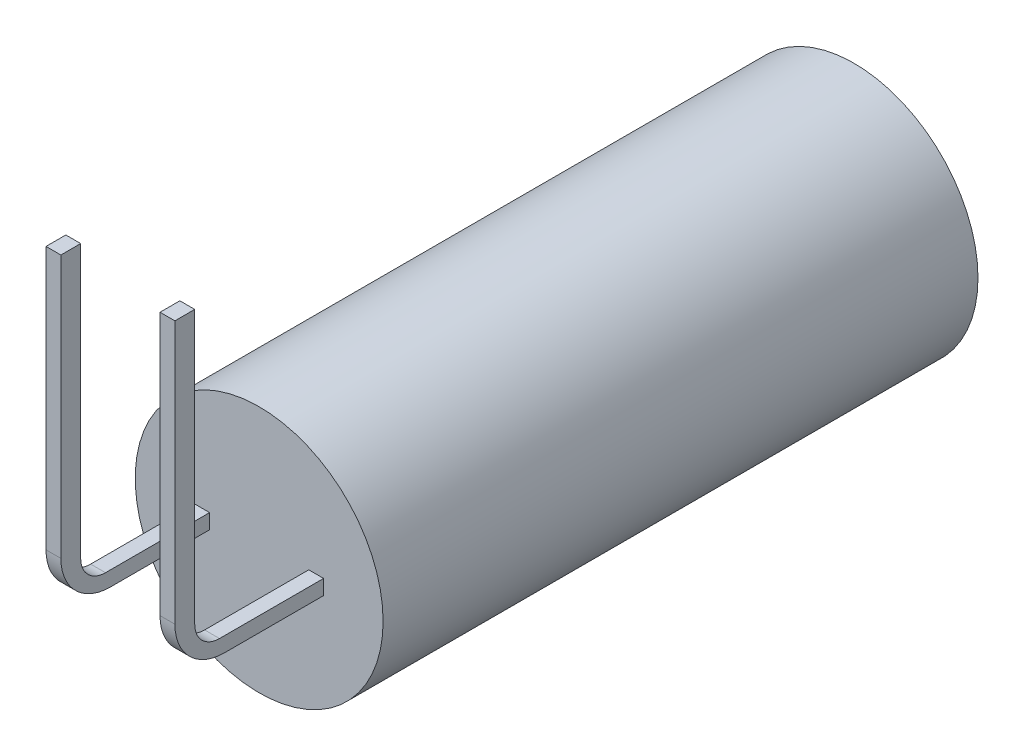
ISO-10303-21;
HEADER;
FILE_DESCRIPTION(('STEP AP214'),'2;1');
FILE_NAME('part.step','',(''),(''),'','','');
FILE_SCHEMA(('AUTOMOTIVE_DESIGN { 1 0 10303 214 1 1 1 1 }'));
ENDSEC;
DATA;
#1=APPLICATION_CONTEXT('core data for automotive mechanical design processes');
#2=APPLICATION_PROTOCOL_DEFINITION('international standard','automotive_design',2000,#1);
#3=PRODUCT_CONTEXT('',#1,'mechanical');
#4=PRODUCT('Part','Part','',(#3));
#5=PRODUCT_RELATED_PRODUCT_CATEGORY('part','',(#4));
#6=PRODUCT_DEFINITION_FORMATION('','',#4);
#7=PRODUCT_DEFINITION_CONTEXT('part definition',#1,'design');
#8=PRODUCT_DEFINITION('design','',#6,#7);
#9=PRODUCT_DEFINITION_SHAPE('','',#8);
#10=(LENGTH_UNIT() NAMED_UNIT(*) SI_UNIT(.MILLI.,.METRE.));
#11=(NAMED_UNIT(*) PLANE_ANGLE_UNIT() SI_UNIT($,.RADIAN.));
#12=(NAMED_UNIT(*) SI_UNIT($,.STERADIAN.) SOLID_ANGLE_UNIT());
#13=UNCERTAINTY_MEASURE_WITH_UNIT(LENGTH_MEASURE(1.E-05),#10,'distance_accuracy_value','');
#14=(GEOMETRIC_REPRESENTATION_CONTEXT(3) GLOBAL_UNCERTAINTY_ASSIGNED_CONTEXT((#13)) GLOBAL_UNIT_ASSIGNED_CONTEXT((#10,
#11,#12)) REPRESENTATION_CONTEXT('',''));
#15=CARTESIAN_POINT('',(0.,0.,0.));
#16=DIRECTION('',(0.,0.,1.));
#17=DIRECTION('',(1.,0.,0.));
#18=AXIS2_PLACEMENT_3D('',#15,#16,#17);
#19=CARTESIAN_POINT('',(-1.3,0.15,3.));
#20=DIRECTION('',(0.,-1.,0.));
#21=DIRECTION('',(0.,0.,-1.));
#22=AXIS2_PLACEMENT_3D('',#19,#20,#21);
#23=PLANE('',#22);
#24=DIRECTION('',(0.,0.,-1.));
#25=VECTOR('',#24,1.);
#26=CARTESIAN_POINT('',(-1.3,0.15,3.));
#27=LINE('',#26,#25);
#28=CARTESIAN_POINT('',(-1.3,0.15,2.1));
#29=VERTEX_POINT('',#28);
#30=CARTESIAN_POINT('',(-1.3,0.15,0.));
#31=VERTEX_POINT('',#30);
#32=EDGE_CURVE('E229',#29,#31,#27,.T.);
#33=ORIENTED_EDGE('',*,*,#32,.F.);
#34=DIRECTION('',(-1.,0.,0.));
#35=VECTOR('',#34,1.);
#36=CARTESIAN_POINT('',(-1.,0.15,2.1));
#37=LINE('',#36,#35);
#38=CARTESIAN_POINT('',(-1.,0.15,2.1));
#39=VERTEX_POINT('',#38);
#40=EDGE_CURVE('E52',#29,#39,#37,.F.);
#41=ORIENTED_EDGE('',*,*,#40,.T.);
#42=DIRECTION('',(0.,0.,-1.));
#43=VECTOR('',#42,1.);
#44=CARTESIAN_POINT('',(-1.,0.15,3.));
#45=LINE('',#44,#43);
#46=CARTESIAN_POINT('',(-1.,0.15,0.));
#47=VERTEX_POINT('',#46);
#48=EDGE_CURVE('E231',#39,#47,#45,.T.);
#49=ORIENTED_EDGE('',*,*,#48,.T.);
#50=DIRECTION('',(-1.,0.,0.));
#51=VECTOR('',#50,1.);
#52=CARTESIAN_POINT('',(-1.3,0.15,0.));
#53=LINE('',#52,#51);
#54=EDGE_CURVE('E221',#47,#31,#53,.T.);
#55=ORIENTED_EDGE('',*,*,#54,.T.);
#56=EDGE_LOOP('',(#33,#41,#49,#55));
#57=FACE_BOUND('',#56,.T.);
#58=ADVANCED_FACE('F31',(#57),#23,.F.);
#59=CARTESIAN_POINT('',(1.3,0.15,3.));
#60=DIRECTION('',(0.,-1.,0.));
#61=DIRECTION('',(1.,0.,0.));
#62=AXIS2_PLACEMENT_3D('',#59,#60,#61);
#63=PLANE('',#62);
#64=DIRECTION('',(0.,0.,-1.));
#65=VECTOR('',#64,1.);
#66=CARTESIAN_POINT('',(1.,0.15,3.));
#67=LINE('',#66,#65);
#68=CARTESIAN_POINT('',(1.,0.15,2.1));
#69=VERTEX_POINT('',#68);
#70=CARTESIAN_POINT('',(1.,0.15,0.));
#71=VERTEX_POINT('',#70);
#72=EDGE_CURVE('E210',#69,#71,#67,.T.);
#73=ORIENTED_EDGE('',*,*,#72,.F.);
#74=DIRECTION('',(-1.,0.,0.));
#75=VECTOR('',#74,1.);
#76=CARTESIAN_POINT('',(1.3,0.15,2.1));
#77=LINE('',#76,#75);
#78=CARTESIAN_POINT('',(1.3,0.15,2.1));
#79=VERTEX_POINT('',#78);
#80=EDGE_CURVE('E264',#69,#79,#77,.F.);
#81=ORIENTED_EDGE('',*,*,#80,.T.);
#82=DIRECTION('',(0.,0.,-1.));
#83=VECTOR('',#82,1.);
#84=CARTESIAN_POINT('',(1.3,0.15,3.));
#85=LINE('',#84,#83);
#86=CARTESIAN_POINT('',(1.3,0.15,0.));
#87=VERTEX_POINT('',#86);
#88=EDGE_CURVE('E204',#79,#87,#85,.T.);
#89=ORIENTED_EDGE('',*,*,#88,.T.);
#90=DIRECTION('',(-1.,0.,0.));
#91=VECTOR('',#90,1.);
#92=CARTESIAN_POINT('',(1.3,0.15,0.));
#93=LINE('',#92,#91);
#94=EDGE_CURVE('E187',#87,#71,#93,.T.);
#95=ORIENTED_EDGE('',*,*,#94,.T.);
#96=EDGE_LOOP('',(#73,#81,#89,#95));
#97=FACE_BOUND('',#96,.T.);
#98=ADVANCED_FACE('F292',(#97),#63,.F.);
#99=CARTESIAN_POINT('',(0.,0.,0.));
#100=DIRECTION('',(0.,0.,1.));
#101=DIRECTION('',(1.,0.,0.));
#102=AXIS2_PLACEMENT_3D('',#99,#100,#101);
#103=PLANE('',#102);
#104=DIRECTION('',(1.,0.,0.));
#105=VECTOR('',#104,1.);
#106=CARTESIAN_POINT('',(-1.3,-0.15,0.));
#107=LINE('',#106,#105);
#108=CARTESIAN_POINT('',(-1.3,-0.15,0.));
#109=VERTEX_POINT('',#108);
#110=CARTESIAN_POINT('',(-1.,-0.15,0.));
#111=VERTEX_POINT('',#110);
#112=EDGE_CURVE('E215',#109,#111,#107,.T.);
#113=ORIENTED_EDGE('',*,*,#112,.F.);
#114=DIRECTION('',(0.,-1.,0.));
#115=VECTOR('',#114,1.);
#116=CARTESIAN_POINT('',(-1.3,0.15,0.));
#117=LINE('',#116,#115);
#118=EDGE_CURVE('E212',#31,#109,#117,.T.);
#119=ORIENTED_EDGE('',*,*,#118,.F.);
#120=ORIENTED_EDGE('',*,*,#54,.F.);
#121=DIRECTION('',(0.,1.,0.));
#122=VECTOR('',#121,1.);
#123=CARTESIAN_POINT('',(-1.,0.15,0.));
#124=LINE('',#123,#122);
#125=EDGE_CURVE('E218',#111,#47,#124,.T.);
#126=ORIENTED_EDGE('',*,*,#125,.F.);
#127=EDGE_LOOP('',(#113,#119,#120,#126));
#128=FACE_BOUND('',#127,.T.);
#129=CARTESIAN_POINT('',(0.,0.,0.));
#130=DIRECTION('',(0.,0.,1.));
#131=DIRECTION('',(1.,0.,0.));
#132=AXIS2_PLACEMENT_3D('',#129,#130,#131);
#133=CIRCLE('',#132,2.5);
#134=CARTESIAN_POINT('',(2.5,0.,0.));
#135=VERTEX_POINT('',#134);
#136=EDGE_CURVE('E237',#135,#135,#133,.T.);
#137=ORIENTED_EDGE('',*,*,#136,.T.);
#138=EDGE_LOOP('',(#137));
#139=FACE_BOUND('',#138,.T.);
#140=DIRECTION('',(0.,-1.,0.));
#141=VECTOR('',#140,1.);
#142=CARTESIAN_POINT('',(1.,0.15,0.));
#143=LINE('',#142,#141);
#144=CARTESIAN_POINT('',(1.,-0.15,0.));
#145=VERTEX_POINT('',#144);
#146=EDGE_CURVE('E190',#71,#145,#143,.T.);
#147=ORIENTED_EDGE('',*,*,#146,.F.);
#148=ORIENTED_EDGE('',*,*,#94,.F.);
#149=DIRECTION('',(0.,1.,0.));
#150=VECTOR('',#149,1.);
#151=CARTESIAN_POINT('',(1.3,0.15,0.));
#152=LINE('',#151,#150);
#153=CARTESIAN_POINT('',(1.3,-0.15,0.));
#154=VERTEX_POINT('',#153);
#155=EDGE_CURVE('E196',#154,#87,#152,.T.);
#156=ORIENTED_EDGE('',*,*,#155,.F.);
#157=DIRECTION('',(1.,0.,0.));
#158=VECTOR('',#157,1.);
#159=CARTESIAN_POINT('',(1.3,-0.15,0.));
#160=LINE('',#159,#158);
#161=EDGE_CURVE('E193',#145,#154,#160,.T.);
#162=ORIENTED_EDGE('',*,*,#161,.F.);
#163=EDGE_LOOP('',(#147,#148,#156,#162));
#164=FACE_BOUND('',#163,.T.);
#165=ADVANCED_FACE('F298',(#128,#139,#164),#103,.T.);
#166=CARTESIAN_POINT('',(0.,0.,-12.));
#167=DIRECTION('',(0.,0.,1.));
#168=DIRECTION('',(1.,0.,0.));
#169=AXIS2_PLACEMENT_3D('',#166,#167,#168);
#170=CYLINDRICAL_SURFACE('',#169,2.5);
#171=CARTESIAN_POINT('',(0.,0.,-12.));
#172=DIRECTION('',(0.,0.,1.));
#173=DIRECTION('',(1.,0.,0.));
#174=AXIS2_PLACEMENT_3D('',#171,#172,#173);
#175=CIRCLE('',#174,2.5);
#176=CARTESIAN_POINT('',(2.5,0.,-12.));
#177=VERTEX_POINT('',#176);
#178=EDGE_CURVE('E240',#177,#177,#175,.T.);
#179=ORIENTED_EDGE('',*,*,#178,.T.);
#180=EDGE_LOOP('',(#179));
#181=FACE_BOUND('',#180,.T.);
#182=ORIENTED_EDGE('',*,*,#136,.F.);
#183=EDGE_LOOP('',(#182));
#184=FACE_BOUND('',#183,.T.);
#185=ADVANCED_FACE('F33',(#181,#184),#170,.T.);
#186=CARTESIAN_POINT('',(0.,0.,-12.));
#187=DIRECTION('',(0.,0.,1.));
#188=DIRECTION('',(1.,0.,0.));
#189=AXIS2_PLACEMENT_3D('',#186,#187,#188);
#190=PLANE('',#189);
#191=ORIENTED_EDGE('',*,*,#178,.F.);
#192=EDGE_LOOP('',(#191));
#193=FACE_BOUND('',#192,.T.);
#194=ADVANCED_FACE('F337',(#193),#190,.F.);
#195=CARTESIAN_POINT('',(-1.3,0.15,3.));
#196=DIRECTION('',(1.,0.,0.));
#197=DIRECTION('',(0.,0.,-1.));
#198=AXIS2_PLACEMENT_3D('',#195,#196,#197);
#199=PLANE('',#198);
#200=DIRECTION('',(0.,0.,-1.));
#201=VECTOR('',#200,1.);
#202=CARTESIAN_POINT('',(-1.3,-0.15,3.));
#203=LINE('',#202,#201);
#204=CARTESIAN_POINT('',(-1.3,-0.15,2.));
#205=VERTEX_POINT('',#204);
#206=EDGE_CURVE('E235',#205,#109,#203,.T.);
#207=ORIENTED_EDGE('',*,*,#206,.F.);
#208=CARTESIAN_POINT('',(-1.3,0.85,2.));
#209=DIRECTION('',(1.,0.,0.));
#210=DIRECTION('',(0.,0.,-1.));
#211=AXIS2_PLACEMENT_3D('',#208,#209,#210);
#212=CIRCLE('',#211,1.);
#213=CARTESIAN_POINT('',(-1.3,0.85,3.));
#214=VERTEX_POINT('',#213);
#215=EDGE_CURVE('E250',#205,#214,#212,.F.);
#216=ORIENTED_EDGE('',*,*,#215,.T.);
#217=DIRECTION('',(0.,-1.,0.));
#218=VECTOR('',#217,1.);
#219=CARTESIAN_POINT('',(-1.3,0.15,3.));
#220=LINE('',#219,#218);
#221=CARTESIAN_POINT('',(-1.3,6.15,3.));
#222=VERTEX_POINT('',#221);
#223=EDGE_CURVE('E224',#222,#214,#220,.T.);
#224=ORIENTED_EDGE('',*,*,#223,.F.);
#225=DIRECTION('',(0.,0.,1.));
#226=VECTOR('',#225,1.);
#227=CARTESIAN_POINT('',(-1.3,6.15,3.));
#228=LINE('',#227,#226);
#229=CARTESIAN_POINT('',(-1.3,6.15,2.6));
#230=VERTEX_POINT('',#229);
#231=EDGE_CURVE('E153',#230,#222,#228,.T.);
#232=ORIENTED_EDGE('',*,*,#231,.F.);
#233=DIRECTION('',(0.,-1.,0.));
#234=VECTOR('',#233,1.);
#235=CARTESIAN_POINT('',(-1.3,6.15,2.6));
#236=LINE('',#235,#234);
#237=CARTESIAN_POINT('',(-1.3,0.65,2.6));
#238=VERTEX_POINT('',#237);
#239=EDGE_CURVE('E149',#230,#238,#236,.T.);
#240=ORIENTED_EDGE('',*,*,#239,.T.);
#241=CARTESIAN_POINT('',(-1.3,0.65,2.1));
#242=DIRECTION('',(1.,0.,0.));
#243=DIRECTION('',(0.,0.,-1.));
#244=AXIS2_PLACEMENT_3D('',#241,#242,#243);
#245=CIRCLE('',#244,0.5);
#246=EDGE_CURVE('E39',#238,#29,#245,.T.);
#247=ORIENTED_EDGE('',*,*,#246,.T.);
#248=ORIENTED_EDGE('',*,*,#32,.T.);
#249=ORIENTED_EDGE('',*,*,#118,.T.);
#250=EDGE_LOOP('',(#207,#216,#224,#232,#240,#247,#248,#249));
#251=FACE_BOUND('',#250,.T.);
#252=ADVANCED_FACE('F333',(#251),#199,.F.);
#253=CARTESIAN_POINT('',(-1.3,-0.15,3.));
#254=DIRECTION('',(0.,1.,0.));
#255=DIRECTION('',(0.,0.,1.));
#256=AXIS2_PLACEMENT_3D('',#253,#254,#255);
#257=PLANE('',#256);
#258=DIRECTION('',(0.,0.,-1.));
#259=VECTOR('',#258,1.);
#260=CARTESIAN_POINT('',(-1.,-0.15,3.));
#261=LINE('',#260,#259);
#262=CARTESIAN_POINT('',(-1.,-0.15,2.));
#263=VERTEX_POINT('',#262);
#264=EDGE_CURVE('E233',#263,#111,#261,.T.);
#265=ORIENTED_EDGE('',*,*,#264,.F.);
#266=DIRECTION('',(1.,0.,0.));
#267=VECTOR('',#266,1.);
#268=CARTESIAN_POINT('',(-1.3,-0.15,2.));
#269=LINE('',#268,#267);
#270=EDGE_CURVE('E248',#263,#205,#269,.F.);
#271=ORIENTED_EDGE('',*,*,#270,.T.);
#272=ORIENTED_EDGE('',*,*,#206,.T.);
#273=ORIENTED_EDGE('',*,*,#112,.T.);
#274=EDGE_LOOP('',(#265,#271,#272,#273));
#275=FACE_BOUND('',#274,.T.);
#276=ADVANCED_FACE('F330',(#275),#257,.F.);
#277=CARTESIAN_POINT('',(-1.,0.15,3.));
#278=DIRECTION('',(-1.,0.,0.));
#279=DIRECTION('',(0.,0.,1.));
#280=AXIS2_PLACEMENT_3D('',#277,#278,#279);
#281=PLANE('',#280);
#282=DIRECTION('',(0.,1.,0.));
#283=VECTOR('',#282,1.);
#284=CARTESIAN_POINT('',(-1.,0.15,3.));
#285=LINE('',#284,#283);
#286=CARTESIAN_POINT('',(-1.,0.85,3.));
#287=VERTEX_POINT('',#286);
#288=CARTESIAN_POINT('',(-1.,6.15,3.));
#289=VERTEX_POINT('',#288);
#290=EDGE_CURVE('E227',#287,#289,#285,.T.);
#291=ORIENTED_EDGE('',*,*,#290,.F.);
#292=CARTESIAN_POINT('',(-1.,0.85,2.));
#293=DIRECTION('',(-1.,0.,0.));
#294=DIRECTION('',(0.,0.,1.));
#295=AXIS2_PLACEMENT_3D('',#292,#293,#294);
#296=CIRCLE('',#295,1.);
#297=EDGE_CURVE('E246',#287,#263,#296,.F.);
#298=ORIENTED_EDGE('',*,*,#297,.T.);
#299=ORIENTED_EDGE('',*,*,#264,.T.);
#300=ORIENTED_EDGE('',*,*,#125,.T.);
#301=ORIENTED_EDGE('',*,*,#48,.F.);
#302=CARTESIAN_POINT('',(-1.,0.65,2.1));
#303=DIRECTION('',(-1.,0.,0.));
#304=DIRECTION('',(0.,0.,1.));
#305=AXIS2_PLACEMENT_3D('',#302,#303,#304);
#306=CIRCLE('',#305,0.5);
#307=CARTESIAN_POINT('',(-1.,0.65,2.6));
#308=VERTEX_POINT('',#307);
#309=EDGE_CURVE('E11',#39,#308,#306,.T.);
#310=ORIENTED_EDGE('',*,*,#309,.T.);
#311=DIRECTION('',(0.,-1.,0.));
#312=VECTOR('',#311,1.);
#313=CARTESIAN_POINT('',(-1.,6.15,2.6));
#314=LINE('',#313,#312);
#315=CARTESIAN_POINT('',(-1.,6.15,2.6));
#316=VERTEX_POINT('',#315);
#317=EDGE_CURVE('E147',#316,#308,#314,.T.);
#318=ORIENTED_EDGE('',*,*,#317,.F.);
#319=DIRECTION('',(0.,0.,-1.));
#320=VECTOR('',#319,1.);
#321=CARTESIAN_POINT('',(-1.,6.15,3.));
#322=LINE('',#321,#320);
#323=EDGE_CURVE('E154',#289,#316,#322,.T.);
#324=ORIENTED_EDGE('',*,*,#323,.F.);
#325=EDGE_LOOP('',(#291,#298,#299,#300,#301,#310,#318,#324));
#326=FACE_BOUND('',#325,.T.);
#327=ADVANCED_FACE('F164',(#326),#281,.F.);
#328=CARTESIAN_POINT('',(-1.3,-0.15,3.));
#329=DIRECTION('',(0.,0.,1.));
#330=DIRECTION('',(1.,0.,0.));
#331=AXIS2_PLACEMENT_3D('',#328,#329,#330);
#332=PLANE('',#331);
#333=ORIENTED_EDGE('',*,*,#223,.T.);
#334=DIRECTION('',(1.,0.,0.));
#335=VECTOR('',#334,1.);
#336=CARTESIAN_POINT('',(-1.,0.85,3.));
#337=LINE('',#336,#335);
#338=EDGE_CURVE('E243',#214,#287,#337,.T.);
#339=ORIENTED_EDGE('',*,*,#338,.T.);
#340=ORIENTED_EDGE('',*,*,#290,.T.);
#341=DIRECTION('',(1.,0.,0.));
#342=VECTOR('',#341,1.);
#343=CARTESIAN_POINT('',(-1.,6.15,3.));
#344=LINE('',#343,#342);
#345=EDGE_CURVE('E160',#222,#289,#344,.T.);
#346=ORIENTED_EDGE('',*,*,#345,.F.);
#347=EDGE_LOOP('',(#333,#339,#340,#346));
#348=FACE_BOUND('',#347,.T.);
#349=ADVANCED_FACE('F327',(#348),#332,.T.);
#350=CARTESIAN_POINT('',(1.,0.15,3.));
#351=DIRECTION('',(1.,0.,0.));
#352=DIRECTION('',(0.,1.,0.));
#353=AXIS2_PLACEMENT_3D('',#350,#351,#352);
#354=PLANE('',#353);
#355=DIRECTION('',(0.,0.,-1.));
#356=VECTOR('',#355,1.);
#357=CARTESIAN_POINT('',(1.,-0.15,3.));
#358=LINE('',#357,#356);
#359=CARTESIAN_POINT('',(1.,-0.15,2.));
#360=VERTEX_POINT('',#359);
#361=EDGE_CURVE('E208',#360,#145,#358,.T.);
#362=ORIENTED_EDGE('',*,*,#361,.F.);
#363=CARTESIAN_POINT('',(0.999999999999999,0.85,2.));
#364=DIRECTION('',(1.,0.,0.));
#365=DIRECTION('',(0.,1.,0.));
#366=AXIS2_PLACEMENT_3D('',#363,#364,#365);
#367=CIRCLE('',#366,1.);
#368=CARTESIAN_POINT('',(0.999999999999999,0.85,3.));
#369=VERTEX_POINT('',#368);
#370=EDGE_CURVE('E259',#360,#369,#367,.F.);
#371=ORIENTED_EDGE('',*,*,#370,.T.);
#372=DIRECTION('',(0.,-1.,0.));
#373=VECTOR('',#372,1.);
#374=CARTESIAN_POINT('',(1.,0.15,3.));
#375=LINE('',#374,#373);
#376=CARTESIAN_POINT('',(0.999999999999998,6.15,3.));
#377=VERTEX_POINT('',#376);
#378=EDGE_CURVE('E199',#377,#369,#375,.T.);
#379=ORIENTED_EDGE('',*,*,#378,.F.);
#380=DIRECTION('',(0.,0.,1.));
#381=VECTOR('',#380,1.);
#382=CARTESIAN_POINT('',(0.999999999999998,6.15,3.));
#383=LINE('',#382,#381);
#384=CARTESIAN_POINT('',(0.999999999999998,6.15,2.6));
#385=VERTEX_POINT('',#384);
#386=EDGE_CURVE('E175',#385,#377,#383,.T.);
#387=ORIENTED_EDGE('',*,*,#386,.F.);
#388=DIRECTION('',(0.,-1.,0.));
#389=VECTOR('',#388,1.);
#390=CARTESIAN_POINT('',(0.999999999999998,6.15,2.6));
#391=LINE('',#390,#389);
#392=CARTESIAN_POINT('',(1.,0.65,2.6));
#393=VERTEX_POINT('',#392);
#394=EDGE_CURVE('E181',#385,#393,#391,.T.);
#395=ORIENTED_EDGE('',*,*,#394,.T.);
#396=CARTESIAN_POINT('',(0.999999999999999,0.65,2.1));
#397=DIRECTION('',(1.,0.,0.));
#398=DIRECTION('',(0.,1.,0.));
#399=AXIS2_PLACEMENT_3D('',#396,#397,#398);
#400=CIRCLE('',#399,0.5);
#401=EDGE_CURVE('E269',#393,#69,#400,.T.);
#402=ORIENTED_EDGE('',*,*,#401,.T.);
#403=ORIENTED_EDGE('',*,*,#72,.T.);
#404=ORIENTED_EDGE('',*,*,#146,.T.);
#405=EDGE_LOOP('',(#362,#371,#379,#387,#395,#402,#403,#404));
#406=FACE_BOUND('',#405,.T.);
#407=ADVANCED_FACE('F289',(#406),#354,.F.);
#408=CARTESIAN_POINT('',(1.3,-0.15,3.));
#409=DIRECTION('',(0.,1.,0.));
#410=DIRECTION('',(-1.,0.,0.));
#411=AXIS2_PLACEMENT_3D('',#408,#409,#410);
#412=PLANE('',#411);
#413=DIRECTION('',(0.,0.,-1.));
#414=VECTOR('',#413,1.);
#415=CARTESIAN_POINT('',(1.3,-0.15,3.));
#416=LINE('',#415,#414);
#417=CARTESIAN_POINT('',(1.3,-0.15,2.));
#418=VERTEX_POINT('',#417);
#419=EDGE_CURVE('E206',#418,#154,#416,.T.);
#420=ORIENTED_EDGE('',*,*,#419,.F.);
#421=DIRECTION('',(1.,0.,0.));
#422=VECTOR('',#421,1.);
#423=CARTESIAN_POINT('',(1.,-0.15,2.));
#424=LINE('',#423,#422);
#425=EDGE_CURVE('E257',#418,#360,#424,.F.);
#426=ORIENTED_EDGE('',*,*,#425,.T.);
#427=ORIENTED_EDGE('',*,*,#361,.T.);
#428=ORIENTED_EDGE('',*,*,#161,.T.);
#429=EDGE_LOOP('',(#420,#426,#427,#428));
#430=FACE_BOUND('',#429,.T.);
#431=ADVANCED_FACE('F389',(#430),#412,.F.);
#432=CARTESIAN_POINT('',(1.3,0.15,3.));
#433=DIRECTION('',(-1.,0.,0.));
#434=DIRECTION('',(0.,-1.,0.));
#435=AXIS2_PLACEMENT_3D('',#432,#433,#434);
#436=PLANE('',#435);
#437=DIRECTION('',(0.,1.,0.));
#438=VECTOR('',#437,1.);
#439=CARTESIAN_POINT('',(1.3,0.15,3.));
#440=LINE('',#439,#438);
#441=CARTESIAN_POINT('',(1.3,0.85,3.));
#442=VERTEX_POINT('',#441);
#443=CARTESIAN_POINT('',(1.3,6.15,3.));
#444=VERTEX_POINT('',#443);
#445=EDGE_CURVE('E202',#442,#444,#440,.T.);
#446=ORIENTED_EDGE('',*,*,#445,.F.);
#447=CARTESIAN_POINT('',(1.3,0.85,2.));
#448=DIRECTION('',(-1.,0.,0.));
#449=DIRECTION('',(0.,-1.,0.));
#450=AXIS2_PLACEMENT_3D('',#447,#448,#449);
#451=CIRCLE('',#450,1.);
#452=EDGE_CURVE('E255',#442,#418,#451,.F.);
#453=ORIENTED_EDGE('',*,*,#452,.T.);
#454=ORIENTED_EDGE('',*,*,#419,.T.);
#455=ORIENTED_EDGE('',*,*,#155,.T.);
#456=ORIENTED_EDGE('',*,*,#88,.F.);
#457=CARTESIAN_POINT('',(1.3,0.65,2.1));
#458=DIRECTION('',(-1.,0.,0.));
#459=DIRECTION('',(0.,-1.,0.));
#460=AXIS2_PLACEMENT_3D('',#457,#458,#459);
#461=CIRCLE('',#460,0.5);
#462=CARTESIAN_POINT('',(1.3,0.65,2.6));
#463=VERTEX_POINT('',#462);
#464=EDGE_CURVE('E271',#79,#463,#461,.T.);
#465=ORIENTED_EDGE('',*,*,#464,.T.);
#466=DIRECTION('',(0.,-1.,0.));
#467=VECTOR('',#466,1.);
#468=CARTESIAN_POINT('',(1.3,6.15,2.6));
#469=LINE('',#468,#467);
#470=CARTESIAN_POINT('',(1.3,6.15,2.6));
#471=VERTEX_POINT('',#470);
#472=EDGE_CURVE('E184',#471,#463,#469,.T.);
#473=ORIENTED_EDGE('',*,*,#472,.F.);
#474=DIRECTION('',(0.,0.,-1.));
#475=VECTOR('',#474,1.);
#476=CARTESIAN_POINT('',(1.3,6.15,3.));
#477=LINE('',#476,#475);
#478=EDGE_CURVE('E166',#444,#471,#477,.T.);
#479=ORIENTED_EDGE('',*,*,#478,.F.);
#480=EDGE_LOOP('',(#446,#453,#454,#455,#456,#465,#473,#479));
#481=FACE_BOUND('',#480,.T.);
#482=ADVANCED_FACE('F277',(#481),#436,.F.);
#483=CARTESIAN_POINT('',(1.,0.15,3.));
#484=DIRECTION('',(0.,0.,1.));
#485=DIRECTION('',(1.,0.,0.));
#486=AXIS2_PLACEMENT_3D('',#483,#484,#485);
#487=PLANE('',#486);
#488=ORIENTED_EDGE('',*,*,#378,.T.);
#489=DIRECTION('',(1.,0.,0.));
#490=VECTOR('',#489,1.);
#491=CARTESIAN_POINT('',(1.3,0.85,3.));
#492=LINE('',#491,#490);
#493=EDGE_CURVE('E252',#369,#442,#492,.T.);
#494=ORIENTED_EDGE('',*,*,#493,.T.);
#495=ORIENTED_EDGE('',*,*,#445,.T.);
#496=DIRECTION('',(1.,0.,0.));
#497=VECTOR('',#496,1.);
#498=CARTESIAN_POINT('',(1.3,6.15,3.));
#499=LINE('',#498,#497);
#500=EDGE_CURVE('E178',#377,#444,#499,.T.);
#501=ORIENTED_EDGE('',*,*,#500,.F.);
#502=EDGE_LOOP('',(#488,#494,#495,#501));
#503=FACE_BOUND('',#502,.T.);
#504=ADVANCED_FACE('F306',(#503),#487,.T.);
#505=CARTESIAN_POINT('',(1.3,6.15,2.6));
#506=DIRECTION('',(0.,0.,1.));
#507=DIRECTION('',(1.,0.,0.));
#508=AXIS2_PLACEMENT_3D('',#505,#506,#507);
#509=PLANE('',#508);
#510=ORIENTED_EDGE('',*,*,#472,.T.);
#511=DIRECTION('',(-1.,0.,0.));
#512=VECTOR('',#511,1.);
#513=CARTESIAN_POINT('',(1.,0.65,2.6));
#514=LINE('',#513,#512);
#515=EDGE_CURVE('E261',#463,#393,#514,.T.);
#516=ORIENTED_EDGE('',*,*,#515,.T.);
#517=ORIENTED_EDGE('',*,*,#394,.F.);
#518=DIRECTION('',(-1.,0.,0.));
#519=VECTOR('',#518,1.);
#520=CARTESIAN_POINT('',(1.3,6.15,2.6));
#521=LINE('',#520,#519);
#522=EDGE_CURVE('E169',#471,#385,#521,.T.);
#523=ORIENTED_EDGE('',*,*,#522,.F.);
#524=EDGE_LOOP('',(#510,#516,#517,#523));
#525=FACE_BOUND('',#524,.T.);
#526=ADVANCED_FACE('F283',(#525),#509,.F.);
#527=CARTESIAN_POINT('',(1.3,6.15,2.6));
#528=DIRECTION('',(0.,1.,0.));
#529=DIRECTION('',(-1.,0.,0.));
#530=AXIS2_PLACEMENT_3D('',#527,#528,#529);
#531=PLANE('',#530);
#532=ORIENTED_EDGE('',*,*,#478,.T.);
#533=ORIENTED_EDGE('',*,*,#522,.T.);
#534=ORIENTED_EDGE('',*,*,#386,.T.);
#535=ORIENTED_EDGE('',*,*,#500,.T.);
#536=EDGE_LOOP('',(#532,#533,#534,#535));
#537=FACE_BOUND('',#536,.T.);
#538=ADVANCED_FACE('F310',(#537),#531,.T.);
#539=CARTESIAN_POINT('',(-1.,6.15,2.6));
#540=DIRECTION('',(0.,0.,1.));
#541=DIRECTION('',(1.,0.,0.));
#542=AXIS2_PLACEMENT_3D('',#539,#540,#541);
#543=PLANE('',#542);
#544=ORIENTED_EDGE('',*,*,#317,.T.);
#545=DIRECTION('',(-1.,0.,0.));
#546=VECTOR('',#545,1.);
#547=CARTESIAN_POINT('',(-1.3,0.65,2.6));
#548=LINE('',#547,#546);
#549=EDGE_CURVE('E266',#308,#238,#548,.T.);
#550=ORIENTED_EDGE('',*,*,#549,.T.);
#551=ORIENTED_EDGE('',*,*,#239,.F.);
#552=DIRECTION('',(-1.,0.,0.));
#553=VECTOR('',#552,1.);
#554=CARTESIAN_POINT('',(-1.,6.15,2.6));
#555=LINE('',#554,#553);
#556=EDGE_CURVE('E142',#316,#230,#555,.T.);
#557=ORIENTED_EDGE('',*,*,#556,.F.);
#558=EDGE_LOOP('',(#544,#550,#551,#557));
#559=FACE_BOUND('',#558,.T.);
#560=ADVANCED_FACE('F144',(#559),#543,.F.);
#561=CARTESIAN_POINT('',(-1.,6.15,2.6));
#562=DIRECTION('',(0.,1.,0.));
#563=DIRECTION('',(-1.,0.,0.));
#564=AXIS2_PLACEMENT_3D('',#561,#562,#563);
#565=PLANE('',#564);
#566=ORIENTED_EDGE('',*,*,#323,.T.);
#567=ORIENTED_EDGE('',*,*,#556,.T.);
#568=ORIENTED_EDGE('',*,*,#231,.T.);
#569=ORIENTED_EDGE('',*,*,#345,.T.);
#570=EDGE_LOOP('',(#566,#567,#568,#569));
#571=FACE_BOUND('',#570,.T.);
#572=ADVANCED_FACE('F158',(#571),#565,.T.);
#573=CARTESIAN_POINT('',(-1.3,0.85,2.));
#574=DIRECTION('',(-1.,0.,0.));
#575=DIRECTION('',(0.,0.,1.));
#576=AXIS2_PLACEMENT_3D('',#573,#574,#575);
#577=CYLINDRICAL_SURFACE('',#576,1.);
#578=ORIENTED_EDGE('',*,*,#215,.F.);
#579=ORIENTED_EDGE('',*,*,#270,.F.);
#580=ORIENTED_EDGE('',*,*,#297,.F.);
#581=ORIENTED_EDGE('',*,*,#338,.F.);
#582=EDGE_LOOP('',(#578,#579,#580,#581));
#583=FACE_BOUND('',#582,.T.);
#584=ADVANCED_FACE('F443',(#583),#577,.T.);
#585=CARTESIAN_POINT('',(1.,0.85,2.));
#586=DIRECTION('',(-1.,0.,0.));
#587=DIRECTION('',(0.,-1.,0.));
#588=AXIS2_PLACEMENT_3D('',#585,#586,#587);
#589=CYLINDRICAL_SURFACE('',#588,1.);
#590=ORIENTED_EDGE('',*,*,#370,.F.);
#591=ORIENTED_EDGE('',*,*,#425,.F.);
#592=ORIENTED_EDGE('',*,*,#452,.F.);
#593=ORIENTED_EDGE('',*,*,#493,.F.);
#594=EDGE_LOOP('',(#590,#591,#592,#593));
#595=FACE_BOUND('',#594,.T.);
#596=ADVANCED_FACE('F304',(#595),#589,.T.);
#597=CARTESIAN_POINT('',(1.3,0.65,2.1));
#598=DIRECTION('',(1.,0.,0.));
#599=DIRECTION('',(0.,1.,0.));
#600=AXIS2_PLACEMENT_3D('',#597,#598,#599);
#601=CYLINDRICAL_SURFACE('',#600,0.5);
#602=ORIENTED_EDGE('',*,*,#464,.F.);
#603=ORIENTED_EDGE('',*,*,#80,.F.);
#604=ORIENTED_EDGE('',*,*,#401,.F.);
#605=ORIENTED_EDGE('',*,*,#515,.F.);
#606=EDGE_LOOP('',(#602,#603,#604,#605));
#607=FACE_BOUND('',#606,.T.);
#608=ADVANCED_FACE('F285',(#607),#601,.F.);
#609=CARTESIAN_POINT('',(-1.,0.65,2.1));
#610=DIRECTION('',(1.,0.,0.));
#611=DIRECTION('',(0.,0.,-1.));
#612=AXIS2_PLACEMENT_3D('',#609,#610,#611);
#613=CYLINDRICAL_SURFACE('',#612,0.5);
#614=ORIENTED_EDGE('',*,*,#309,.F.);
#615=ORIENTED_EDGE('',*,*,#40,.F.);
#616=ORIENTED_EDGE('',*,*,#246,.F.);
#617=ORIENTED_EDGE('',*,*,#549,.F.);
#618=EDGE_LOOP('',(#614,#615,#616,#617));
#619=FACE_BOUND('',#618,.T.);
#620=ADVANCED_FACE('F426',(#619),#613,.F.);
#621=CLOSED_SHELL('',(#58,#98,#165,#185,#194,#252,#276,#327,#349,#407,#431,#482,#504,#526,#538,
#560,#572,#584,#596,#608,#620));
#622=MANIFOLD_SOLID_BREP('B2',#621);
#623=ADVANCED_BREP_SHAPE_REPRESENTATION('',(#18,#622),#14);
#624=SHAPE_DEFINITION_REPRESENTATION(#9,#623);
ENDSEC;
END-ISO-10303-21;
